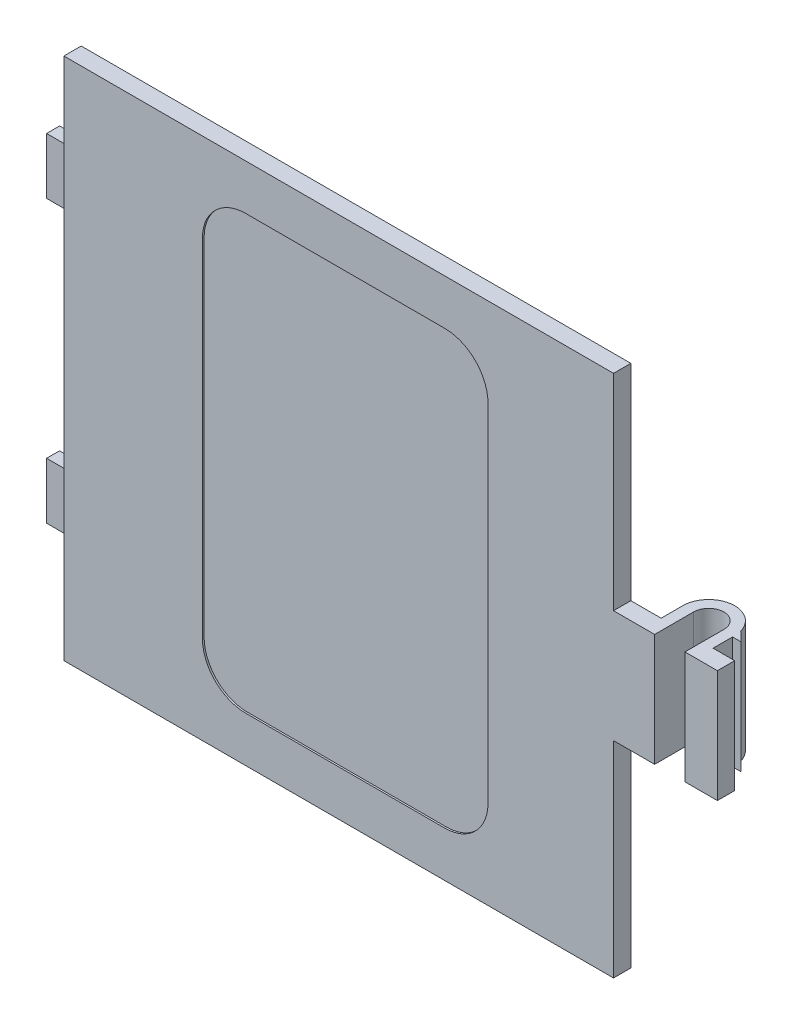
ISO-10303-21;
HEADER;
FILE_DESCRIPTION(('STEP AP214'),'2;1');
FILE_NAME('part.step','',(''),(''),'','','');
FILE_SCHEMA(('AUTOMOTIVE_DESIGN { 1 0 10303 214 1 1 1 1 }'));
ENDSEC;
DATA;
#1=APPLICATION_CONTEXT('core data for automotive mechanical design processes');
#2=APPLICATION_PROTOCOL_DEFINITION('international standard','automotive_design',2000,#1);
#3=PRODUCT_CONTEXT('',#1,'mechanical');
#4=PRODUCT('Part','Part','',(#3));
#5=PRODUCT_RELATED_PRODUCT_CATEGORY('part','',(#4));
#6=PRODUCT_DEFINITION_FORMATION('','',#4);
#7=PRODUCT_DEFINITION_CONTEXT('part definition',#1,'design');
#8=PRODUCT_DEFINITION('design','',#6,#7);
#9=PRODUCT_DEFINITION_SHAPE('','',#8);
#10=(LENGTH_UNIT() NAMED_UNIT(*) SI_UNIT(.MILLI.,.METRE.));
#11=(NAMED_UNIT(*) PLANE_ANGLE_UNIT() SI_UNIT($,.RADIAN.));
#12=(NAMED_UNIT(*) SI_UNIT($,.STERADIAN.) SOLID_ANGLE_UNIT());
#13=UNCERTAINTY_MEASURE_WITH_UNIT(LENGTH_MEASURE(1.E-05),#10,'distance_accuracy_value','');
#14=(GEOMETRIC_REPRESENTATION_CONTEXT(3) GLOBAL_UNCERTAINTY_ASSIGNED_CONTEXT((#13)) GLOBAL_UNIT_ASSIGNED_CONTEXT((#10,
#11,#12)) REPRESENTATION_CONTEXT('',''));
#15=CARTESIAN_POINT('',(0.,0.,0.));
#16=DIRECTION('',(0.,0.,1.));
#17=DIRECTION('',(1.,0.,0.));
#18=AXIS2_PLACEMENT_3D('',#15,#16,#17);
#19=CARTESIAN_POINT('',(21.75,30.25,-89.7068982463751));
#20=DIRECTION('',(1.,0.,0.));
#21=DIRECTION('',(0.,1.,0.));
#22=AXIS2_PLACEMENT_3D('',#19,#20,#21);
#23=PLANE('',#22);
#24=DIRECTION('',(0.,1.,0.));
#25=VECTOR('',#24,1.);
#26=CARTESIAN_POINT('',(21.75,30.25,0.));
#27=LINE('',#26,#25);
#28=CARTESIAN_POINT('',(21.75,6.50000000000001,0.));
#29=VERTEX_POINT('',#28);
#30=CARTESIAN_POINT('',(21.75,30.25,0.));
#31=VERTEX_POINT('',#30);
#32=EDGE_CURVE('E543',#29,#31,#27,.T.);
#33=ORIENTED_EDGE('',*,*,#32,.F.);
#34=DIRECTION('',(0.,0.,-1.));
#35=VECTOR('',#34,1.);
#36=CARTESIAN_POINT('',(21.75,6.50000000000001,-2.));
#37=LINE('',#36,#35);
#38=CARTESIAN_POINT('',(21.75,6.50000000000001,-2.));
#39=VERTEX_POINT('',#38);
#40=EDGE_CURVE('E449',#29,#39,#37,.T.);
#41=ORIENTED_EDGE('',*,*,#40,.T.);
#42=DIRECTION('',(0.,-1.,0.));
#43=VECTOR('',#42,1.);
#44=CARTESIAN_POINT('',(21.75,30.25,-2.));
#45=LINE('',#44,#43);
#46=CARTESIAN_POINT('',(21.75,30.25,-2.));
#47=VERTEX_POINT('',#46);
#48=EDGE_CURVE('E463',#47,#39,#45,.T.);
#49=ORIENTED_EDGE('',*,*,#48,.F.);
#50=DIRECTION('',(0.,0.,1.));
#51=VECTOR('',#50,1.);
#52=CARTESIAN_POINT('',(21.75,30.25,-89.7068982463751));
#53=LINE('',#52,#51);
#54=EDGE_CURVE('E591',#47,#31,#53,.T.);
#55=ORIENTED_EDGE('',*,*,#54,.T.);
#56=EDGE_LOOP('',(#33,#41,#49,#55));
#57=FACE_BOUND('',#56,.T.);
#58=ADVANCED_FACE('F34',(#57),#23,.T.);
#59=CARTESIAN_POINT('',(21.75,-30.25,-89.7068982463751));
#60=DIRECTION('',(0.,-1.,0.));
#61=DIRECTION('',(1.,0.,0.));
#62=AXIS2_PLACEMENT_3D('',#59,#60,#61);
#63=PLANE('',#62);
#64=DIRECTION('',(-1.,0.,0.));
#65=VECTOR('',#64,1.);
#66=CARTESIAN_POINT('',(21.75,-30.25,-2.));
#67=LINE('',#66,#65);
#68=CARTESIAN_POINT('',(21.75,-30.25,-2.));
#69=VERTEX_POINT('',#68);
#70=CARTESIAN_POINT('',(-41.75,-30.25,-2.));
#71=VERTEX_POINT('',#70);
#72=EDGE_CURVE('E492',#69,#71,#67,.T.);
#73=ORIENTED_EDGE('',*,*,#72,.F.);
#74=DIRECTION('',(0.,0.,1.));
#75=VECTOR('',#74,1.);
#76=CARTESIAN_POINT('',(21.75,-30.25,-89.7068982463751));
#77=LINE('',#76,#75);
#78=CARTESIAN_POINT('',(21.75,-30.25,0.));
#79=VERTEX_POINT('',#78);
#80=EDGE_CURVE('E588',#69,#79,#77,.T.);
#81=ORIENTED_EDGE('',*,*,#80,.T.);
#82=DIRECTION('',(1.,0.,0.));
#83=VECTOR('',#82,1.);
#84=CARTESIAN_POINT('',(21.75,-30.25,0.));
#85=LINE('',#84,#83);
#86=CARTESIAN_POINT('',(-41.75,-30.25,0.));
#87=VERTEX_POINT('',#86);
#88=EDGE_CURVE('E508',#87,#79,#85,.T.);
#89=ORIENTED_EDGE('',*,*,#88,.F.);
#90=DIRECTION('',(0.,0.,1.));
#91=VECTOR('',#90,1.);
#92=CARTESIAN_POINT('',(-41.75,-30.25,-89.7068982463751));
#93=LINE('',#92,#91);
#94=EDGE_CURVE('E500',#71,#87,#93,.T.);
#95=ORIENTED_EDGE('',*,*,#94,.F.);
#96=EDGE_LOOP('',(#73,#81,#89,#95));
#97=FACE_BOUND('',#96,.T.);
#98=ADVANCED_FACE('F36',(#97),#63,.T.);
#99=CARTESIAN_POINT('',(-41.75,-30.25,-89.7068982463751));
#100=DIRECTION('',(-1.,0.,0.));
#101=DIRECTION('',(0.,-1.,0.));
#102=AXIS2_PLACEMENT_3D('',#99,#100,#101);
#103=PLANE('',#102);
#104=DIRECTION('',(0.,1.,0.));
#105=VECTOR('',#104,1.);
#106=CARTESIAN_POINT('',(-41.75,-30.25,-2.));
#107=LINE('',#106,#105);
#108=CARTESIAN_POINT('',(-41.75,-19.5,-2.));
#109=VERTEX_POINT('',#108);
#110=EDGE_CURVE('E488',#71,#109,#107,.T.);
#111=ORIENTED_EDGE('',*,*,#110,.F.);
#112=ORIENTED_EDGE('',*,*,#94,.T.);
#113=DIRECTION('',(0.,-1.,0.));
#114=VECTOR('',#113,1.);
#115=CARTESIAN_POINT('',(-41.75,-30.25,0.));
#116=LINE('',#115,#114);
#117=CARTESIAN_POINT('',(-41.75,30.25,0.));
#118=VERTEX_POINT('',#117);
#119=EDGE_CURVE('E586',#118,#87,#116,.T.);
#120=ORIENTED_EDGE('',*,*,#119,.F.);
#121=DIRECTION('',(0.,0.,1.));
#122=VECTOR('',#121,1.);
#123=CARTESIAN_POINT('',(-41.75,30.25,-89.7068982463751));
#124=LINE('',#123,#122);
#125=CARTESIAN_POINT('',(-41.75,30.25,-2.));
#126=VERTEX_POINT('',#125);
#127=EDGE_CURVE('E503',#126,#118,#124,.T.);
#128=ORIENTED_EDGE('',*,*,#127,.F.);
#129=CARTESIAN_POINT('',(-41.75,19.5,-2.));
#130=VERTEX_POINT('',#129);
#131=EDGE_CURVE('E491',#130,#126,#107,.T.);
#132=ORIENTED_EDGE('',*,*,#131,.F.);
#133=CARTESIAN_POINT('',(-41.75,13.,-2.));
#134=VERTEX_POINT('',#133);
#135=EDGE_CURVE('E493',#134,#130,#107,.T.);
#136=ORIENTED_EDGE('',*,*,#135,.F.);
#137=CARTESIAN_POINT('',(-41.75,-13.,-2.));
#138=VERTEX_POINT('',#137);
#139=EDGE_CURVE('E489',#138,#134,#107,.T.);
#140=ORIENTED_EDGE('',*,*,#139,.F.);
#141=EDGE_CURVE('E485',#109,#138,#107,.T.);
#142=ORIENTED_EDGE('',*,*,#141,.F.);
#143=EDGE_LOOP('',(#111,#112,#120,#128,#132,#136,#140,#142));
#144=FACE_BOUND('',#143,.T.);
#145=ADVANCED_FACE('F603',(#144),#103,.T.);
#146=CARTESIAN_POINT('',(-41.75,30.25,-89.7068982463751));
#147=DIRECTION('',(0.,1.,0.));
#148=DIRECTION('',(-1.,0.,0.));
#149=AXIS2_PLACEMENT_3D('',#146,#147,#148);
#150=PLANE('',#149);
#151=DIRECTION('',(1.,0.,0.));
#152=VECTOR('',#151,1.);
#153=CARTESIAN_POINT('',(-41.75,30.25,-2.));
#154=LINE('',#153,#152);
#155=EDGE_CURVE('E496',#126,#47,#154,.T.);
#156=ORIENTED_EDGE('',*,*,#155,.F.);
#157=ORIENTED_EDGE('',*,*,#127,.T.);
#158=DIRECTION('',(-1.,0.,0.));
#159=VECTOR('',#158,1.);
#160=CARTESIAN_POINT('',(-41.75,30.25,0.));
#161=LINE('',#160,#159);
#162=EDGE_CURVE('E580',#31,#118,#161,.T.);
#163=ORIENTED_EDGE('',*,*,#162,.F.);
#164=ORIENTED_EDGE('',*,*,#54,.F.);
#165=EDGE_LOOP('',(#156,#157,#163,#164));
#166=FACE_BOUND('',#165,.T.);
#167=ADVANCED_FACE('F621',(#166),#150,.T.);
#168=DIRECTION('',(0.,0.,-1.));
#169=VECTOR('',#168,1.);
#170=CARTESIAN_POINT('',(21.75,-6.49999999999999,-2.));
#171=LINE('',#170,#169);
#172=CARTESIAN_POINT('',(21.75,-6.49999999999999,0.));
#173=VERTEX_POINT('',#172);
#174=CARTESIAN_POINT('',(21.75,-6.49999999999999,-2.));
#175=VERTEX_POINT('',#174);
#176=EDGE_CURVE('E533',#173,#175,#171,.T.);
#177=ORIENTED_EDGE('',*,*,#176,.F.);
#178=EDGE_CURVE('E578',#79,#173,#27,.T.);
#179=ORIENTED_EDGE('',*,*,#178,.F.);
#180=ORIENTED_EDGE('',*,*,#80,.F.);
#181=EDGE_CURVE('E572',#175,#69,#45,.T.);
#182=ORIENTED_EDGE('',*,*,#181,.F.);
#183=EDGE_LOOP('',(#177,#179,#180,#182));
#184=FACE_BOUND('',#183,.T.);
#185=ADVANCED_FACE('F599',(#184),#23,.T.);
#186=CARTESIAN_POINT('',(21.75,-30.25,0.));
#187=DIRECTION('',(0.,0.,1.));
#188=DIRECTION('',(1.,0.,0.));
#189=AXIS2_PLACEMENT_3D('',#186,#187,#188);
#190=PLANE('',#189);
#191=CARTESIAN_POINT('',(2.25000000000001,-20.,0.));
#192=DIRECTION('',(0.,0.,1.));
#193=DIRECTION('',(-1.,0.,0.));
#194=AXIS2_PLACEMENT_3D('',#191,#192,#193);
#195=CIRCLE('',#194,5.);
#196=CARTESIAN_POINT('',(2.24999999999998,-25.,0.));
#197=VERTEX_POINT('',#196);
#198=CARTESIAN_POINT('',(7.25000000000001,-20.,0.));
#199=VERTEX_POINT('',#198);
#200=EDGE_CURVE('E49',#197,#199,#195,.T.);
#201=ORIENTED_EDGE('',*,*,#200,.F.);
#202=DIRECTION('',(1.,0.,0.));
#203=VECTOR('',#202,1.);
#204=CARTESIAN_POINT('',(-20.75,-25.,0.));
#205=LINE('',#204,#203);
#206=CARTESIAN_POINT('',(-20.75,-25.,0.));
#207=VERTEX_POINT('',#206);
#208=EDGE_CURVE('E293',#207,#197,#205,.T.);
#209=ORIENTED_EDGE('',*,*,#208,.F.);
#210=CARTESIAN_POINT('',(-20.75,-20.,0.));
#211=DIRECTION('',(0.,0.,1.));
#212=DIRECTION('',(-1.,0.,0.));
#213=AXIS2_PLACEMENT_3D('',#210,#211,#212);
#214=CIRCLE('',#213,5.);
#215=CARTESIAN_POINT('',(-25.75,-20.,0.));
#216=VERTEX_POINT('',#215);
#217=EDGE_CURVE('E296',#216,#207,#214,.T.);
#218=ORIENTED_EDGE('',*,*,#217,.F.);
#219=DIRECTION('',(0.,-1.,0.));
#220=VECTOR('',#219,1.);
#221=CARTESIAN_POINT('',(-25.75,-20.,0.));
#222=LINE('',#221,#220);
#223=CARTESIAN_POINT('',(-25.75,20.,0.));
#224=VERTEX_POINT('',#223);
#225=EDGE_CURVE('E324',#224,#216,#222,.T.);
#226=ORIENTED_EDGE('',*,*,#225,.F.);
#227=CARTESIAN_POINT('',(-20.75,20.,0.));
#228=DIRECTION('',(0.,0.,1.));
#229=DIRECTION('',(1.,0.,0.));
#230=AXIS2_PLACEMENT_3D('',#227,#228,#229);
#231=CIRCLE('',#230,5.);
#232=CARTESIAN_POINT('',(-20.75,25.,0.));
#233=VERTEX_POINT('',#232);
#234=EDGE_CURVE('E321',#233,#224,#231,.T.);
#235=ORIENTED_EDGE('',*,*,#234,.F.);
#236=DIRECTION('',(-1.,0.,0.));
#237=VECTOR('',#236,1.);
#238=CARTESIAN_POINT('',(-20.75,25.,0.));
#239=LINE('',#238,#237);
#240=CARTESIAN_POINT('',(2.24999999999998,25.,0.));
#241=VERTEX_POINT('',#240);
#242=EDGE_CURVE('E318',#241,#233,#239,.T.);
#243=ORIENTED_EDGE('',*,*,#242,.F.);
#244=CARTESIAN_POINT('',(2.25000000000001,20.,0.));
#245=DIRECTION('',(0.,0.,1.));
#246=DIRECTION('',(1.,0.,0.));
#247=AXIS2_PLACEMENT_3D('',#244,#245,#246);
#248=CIRCLE('',#247,5.);
#249=CARTESIAN_POINT('',(7.25000000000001,20.,0.));
#250=VERTEX_POINT('',#249);
#251=EDGE_CURVE('E315',#250,#241,#248,.T.);
#252=ORIENTED_EDGE('',*,*,#251,.F.);
#253=DIRECTION('',(0.,1.,0.));
#254=VECTOR('',#253,1.);
#255=CARTESIAN_POINT('',(7.25000000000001,20.,0.));
#256=LINE('',#255,#254);
#257=EDGE_CURVE('E313',#199,#250,#256,.T.);
#258=ORIENTED_EDGE('',*,*,#257,.F.);
#259=EDGE_LOOP('',(#201,#209,#218,#226,#235,#243,#252,#258));
#260=FACE_BOUND('',#259,.T.);
#261=ORIENTED_EDGE('',*,*,#88,.T.);
#262=ORIENTED_EDGE('',*,*,#178,.T.);
#263=DIRECTION('',(-1.,0.,0.));
#264=VECTOR('',#263,1.);
#265=CARTESIAN_POINT('',(21.75,-6.49999999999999,0.));
#266=LINE('',#265,#264);
#267=CARTESIAN_POINT('',(26.5,-6.49999999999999,0.));
#268=VERTEX_POINT('',#267);
#269=EDGE_CURVE('E542',#268,#173,#266,.T.);
#270=ORIENTED_EDGE('',*,*,#269,.F.);
#271=DIRECTION('',(0.,1.,0.));
#272=VECTOR('',#271,1.);
#273=CARTESIAN_POINT('',(26.5,-6.49999999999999,0.));
#274=LINE('',#273,#272);
#275=CARTESIAN_POINT('',(26.5,6.50000000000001,0.));
#276=VERTEX_POINT('',#275);
#277=EDGE_CURVE('E531',#268,#276,#274,.T.);
#278=ORIENTED_EDGE('',*,*,#277,.T.);
#279=DIRECTION('',(-1.,0.,0.));
#280=VECTOR('',#279,1.);
#281=CARTESIAN_POINT('',(21.75,6.50000000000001,0.));
#282=LINE('',#281,#280);
#283=EDGE_CURVE('E443',#276,#29,#282,.T.);
#284=ORIENTED_EDGE('',*,*,#283,.T.);
#285=ORIENTED_EDGE('',*,*,#32,.T.);
#286=ORIENTED_EDGE('',*,*,#162,.T.);
#287=ORIENTED_EDGE('',*,*,#119,.T.);
#288=EDGE_LOOP('',(#261,#262,#270,#278,#284,#285,#286,#287));
#289=FACE_BOUND('',#288,.T.);
#290=ADVANCED_FACE('F558',(#260,#289),#190,.T.);
#291=CARTESIAN_POINT('',(-40.,-30.5,-2.));
#292=DIRECTION('',(0.,0.,1.));
#293=DIRECTION('',(1.,0.,0.));
#294=AXIS2_PLACEMENT_3D('',#291,#292,#293);
#295=PLANE('',#294);
#296=ORIENTED_EDGE('',*,*,#110,.T.);
#297=DIRECTION('',(1.,0.,0.));
#298=VECTOR('',#297,1.);
#299=CARTESIAN_POINT('',(-40.,-19.5,-2.));
#300=LINE('',#299,#298);
#301=CARTESIAN_POINT('',(-39.75,-19.5,-2.));
#302=VERTEX_POINT('',#301);
#303=EDGE_CURVE('E11',#109,#302,#300,.T.);
#304=ORIENTED_EDGE('',*,*,#303,.T.);
#305=DIRECTION('',(0.,1.,0.));
#306=VECTOR('',#305,1.);
#307=CARTESIAN_POINT('',(-39.75,-19.5,-2.));
#308=LINE('',#307,#306);
#309=CARTESIAN_POINT('',(-39.75,-13.,-2.));
#310=VERTEX_POINT('',#309);
#311=EDGE_CURVE('E372',#302,#310,#308,.T.);
#312=ORIENTED_EDGE('',*,*,#311,.T.);
#313=DIRECTION('',(1.,0.,0.));
#314=VECTOR('',#313,1.);
#315=CARTESIAN_POINT('',(-40.,-13.,-2.));
#316=LINE('',#315,#314);
#317=EDGE_CURVE('E42',#138,#310,#316,.T.);
#318=ORIENTED_EDGE('',*,*,#317,.F.);
#319=ORIENTED_EDGE('',*,*,#139,.T.);
#320=DIRECTION('',(-1.,0.,0.));
#321=VECTOR('',#320,1.);
#322=CARTESIAN_POINT('',(-40.,13.,-2.));
#323=LINE('',#322,#321);
#324=CARTESIAN_POINT('',(-39.75,13.,-2.));
#325=VERTEX_POINT('',#324);
#326=EDGE_CURVE('E459',#325,#134,#323,.T.);
#327=ORIENTED_EDGE('',*,*,#326,.F.);
#328=DIRECTION('',(0.,-1.,0.));
#329=VECTOR('',#328,1.);
#330=CARTESIAN_POINT('',(-39.75,19.5,-2.));
#331=LINE('',#330,#329);
#332=CARTESIAN_POINT('',(-39.75,19.5,-2.));
#333=VERTEX_POINT('',#332);
#334=EDGE_CURVE('E386',#333,#325,#331,.T.);
#335=ORIENTED_EDGE('',*,*,#334,.F.);
#336=DIRECTION('',(-1.,0.,0.));
#337=VECTOR('',#336,1.);
#338=CARTESIAN_POINT('',(-40.,19.5,-2.));
#339=LINE('',#338,#337);
#340=EDGE_CURVE('E462',#333,#130,#339,.T.);
#341=ORIENTED_EDGE('',*,*,#340,.T.);
#342=ORIENTED_EDGE('',*,*,#131,.T.);
#343=ORIENTED_EDGE('',*,*,#155,.T.);
#344=ORIENTED_EDGE('',*,*,#48,.T.);
#345=DIRECTION('',(1.,0.,0.));
#346=VECTOR('',#345,1.);
#347=CARTESIAN_POINT('',(21.75,6.50000000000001,-2.));
#348=LINE('',#347,#346);
#349=CARTESIAN_POINT('',(25.25,6.50000000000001,-2.));
#350=VERTEX_POINT('',#349);
#351=EDGE_CURVE('E406',#39,#350,#348,.T.);
#352=ORIENTED_EDGE('',*,*,#351,.T.);
#353=DIRECTION('',(0.,1.,0.));
#354=VECTOR('',#353,1.);
#355=CARTESIAN_POINT('',(25.25,-6.49999999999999,-2.));
#356=LINE('',#355,#354);
#357=CARTESIAN_POINT('',(25.25,-6.49999999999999,-2.));
#358=VERTEX_POINT('',#357);
#359=EDGE_CURVE('E506',#358,#350,#356,.T.);
#360=ORIENTED_EDGE('',*,*,#359,.F.);
#361=DIRECTION('',(1.,0.,0.));
#362=VECTOR('',#361,1.);
#363=CARTESIAN_POINT('',(21.75,-6.49999999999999,-2.));
#364=LINE('',#363,#362);
#365=EDGE_CURVE('E452',#175,#358,#364,.T.);
#366=ORIENTED_EDGE('',*,*,#365,.F.);
#367=ORIENTED_EDGE('',*,*,#181,.T.);
#368=ORIENTED_EDGE('',*,*,#72,.T.);
#369=EDGE_LOOP('',(#296,#304,#312,#318,#319,#327,#335,#341,#342,#343,#344,#352,#360,#366,#367,#368));
#370=FACE_BOUND('',#369,.T.);
#371=ADVANCED_FACE('F570',(#370),#295,.F.);
#372=CARTESIAN_POINT('',(25.25,-6.49999999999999,-2.));
#373=DIRECTION('',(1.,0.,0.));
#374=DIRECTION('',(0.,1.,0.));
#375=AXIS2_PLACEMENT_3D('',#372,#373,#374);
#376=PLANE('',#375);
#377=ORIENTED_EDGE('',*,*,#359,.T.);
#378=DIRECTION('',(0.,0.,-1.));
#379=VECTOR('',#378,1.);
#380=CARTESIAN_POINT('',(25.25,6.50000000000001,-2.));
#381=LINE('',#380,#379);
#382=CARTESIAN_POINT('',(25.25,6.50000000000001,-4.5));
#383=VERTEX_POINT('',#382);
#384=EDGE_CURVE('E407',#350,#383,#381,.T.);
#385=ORIENTED_EDGE('',*,*,#384,.T.);
#386=DIRECTION('',(0.,1.,0.));
#387=VECTOR('',#386,1.);
#388=CARTESIAN_POINT('',(25.25,-6.49999999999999,-4.5));
#389=LINE('',#388,#387);
#390=CARTESIAN_POINT('',(25.25,-6.49999999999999,-4.5));
#391=VERTEX_POINT('',#390);
#392=EDGE_CURVE('E509',#391,#383,#389,.T.);
#393=ORIENTED_EDGE('',*,*,#392,.F.);
#394=DIRECTION('',(0.,0.,-1.));
#395=VECTOR('',#394,1.);
#396=CARTESIAN_POINT('',(25.25,-6.49999999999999,-2.));
#397=LINE('',#396,#395);
#398=EDGE_CURVE('E446',#358,#391,#397,.T.);
#399=ORIENTED_EDGE('',*,*,#398,.F.);
#400=EDGE_LOOP('',(#377,#385,#393,#399));
#401=FACE_BOUND('',#400,.T.);
#402=ADVANCED_FACE('F636',(#401),#376,.F.);
#403=CARTESIAN_POINT('',(28.25,-6.49999999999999,-4.5));
#404=DIRECTION('',(0.,1.,0.));
#405=DIRECTION('',(-1.,0.,0.));
#406=AXIS2_PLACEMENT_3D('',#403,#404,#405);
#407=CYLINDRICAL_SURFACE('',#406,3.);
#408=ORIENTED_EDGE('',*,*,#392,.T.);
#409=CARTESIAN_POINT('',(28.25,6.50000000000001,-4.5));
#410=DIRECTION('',(0.,-1.,0.));
#411=DIRECTION('',(1.,0.,0.));
#412=AXIS2_PLACEMENT_3D('',#409,#410,#411);
#413=CIRCLE('',#412,3.);
#414=CARTESIAN_POINT('',(31.1547375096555,6.50000000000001,-5.25));
#415=VERTEX_POINT('',#414);
#416=EDGE_CURVE('E410',#383,#415,#413,.T.);
#417=ORIENTED_EDGE('',*,*,#416,.T.);
#418=DIRECTION('',(0.,1.,0.));
#419=VECTOR('',#418,1.);
#420=CARTESIAN_POINT('',(31.1547375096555,-6.49999999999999,-5.25));
#421=LINE('',#420,#419);
#422=CARTESIAN_POINT('',(31.1547375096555,-6.49999999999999,-5.25));
#423=VERTEX_POINT('',#422);
#424=EDGE_CURVE('E511',#423,#415,#421,.T.);
#425=ORIENTED_EDGE('',*,*,#424,.F.);
#426=CARTESIAN_POINT('',(28.25,-6.49999999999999,-4.5));
#427=DIRECTION('',(0.,-1.,0.));
#428=DIRECTION('',(1.,0.,0.));
#429=AXIS2_PLACEMENT_3D('',#426,#427,#428);
#430=CIRCLE('',#429,3.);
#431=EDGE_CURVE('E1027',#391,#423,#430,.T.);
#432=ORIENTED_EDGE('',*,*,#431,.F.);
#433=EDGE_LOOP('',(#408,#417,#425,#432));
#434=FACE_BOUND('',#433,.T.);
#435=ADVANCED_FACE('F639',(#434),#407,.T.);
#436=CARTESIAN_POINT('',(31.25,-6.49999999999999,-5.25));
#437=DIRECTION('',(0.,0.,1.));
#438=DIRECTION('',(1.,0.,0.));
#439=AXIS2_PLACEMENT_3D('',#436,#437,#438);
#440=PLANE('',#439);
#441=ORIENTED_EDGE('',*,*,#424,.T.);
#442=DIRECTION('',(1.,0.,0.));
#443=VECTOR('',#442,1.);
#444=CARTESIAN_POINT('',(31.25,6.50000000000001,-5.25));
#445=LINE('',#444,#443);
#446=CARTESIAN_POINT('',(31.25,6.50000000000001,-5.25));
#447=VERTEX_POINT('',#446);
#448=EDGE_CURVE('E413',#415,#447,#445,.T.);
#449=ORIENTED_EDGE('',*,*,#448,.T.);
#450=DIRECTION('',(0.,1.,0.));
#451=VECTOR('',#450,1.);
#452=CARTESIAN_POINT('',(31.25,-6.49999999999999,-5.25));
#453=LINE('',#452,#451);
#454=CARTESIAN_POINT('',(31.25,-6.49999999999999,-5.25));
#455=VERTEX_POINT('',#454);
#456=EDGE_CURVE('E513',#455,#447,#453,.T.);
#457=ORIENTED_EDGE('',*,*,#456,.F.);
#458=DIRECTION('',(1.,0.,0.));
#459=VECTOR('',#458,1.);
#460=CARTESIAN_POINT('',(31.25,-6.49999999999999,-5.25));
#461=LINE('',#460,#459);
#462=EDGE_CURVE('E1028',#423,#455,#461,.T.);
#463=ORIENTED_EDGE('',*,*,#462,.F.);
#464=EDGE_LOOP('',(#441,#449,#457,#463));
#465=FACE_BOUND('',#464,.T.);
#466=ADVANCED_FACE('F643',(#465),#440,.F.);
#467=CARTESIAN_POINT('',(32.25,-6.49999999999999,-4.25));
#468=DIRECTION('',(-0.707106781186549,0.,0.707106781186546));
#469=DIRECTION('',(0.707106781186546,0.,0.707106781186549));
#470=AXIS2_PLACEMENT_3D('',#467,#468,#469);
#471=PLANE('',#470);
#472=ORIENTED_EDGE('',*,*,#456,.T.);
#473=DIRECTION('',(0.707106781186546,0.,0.707106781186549));
#474=VECTOR('',#473,1.);
#475=CARTESIAN_POINT('',(32.25,6.50000000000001,-4.25));
#476=LINE('',#475,#474);
#477=CARTESIAN_POINT('',(32.25,6.50000000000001,-4.25));
#478=VERTEX_POINT('',#477);
#479=EDGE_CURVE('E416',#447,#478,#476,.T.);
#480=ORIENTED_EDGE('',*,*,#479,.T.);
#481=DIRECTION('',(0.,1.,0.));
#482=VECTOR('',#481,1.);
#483=CARTESIAN_POINT('',(32.25,-6.49999999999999,-4.25));
#484=LINE('',#483,#482);
#485=CARTESIAN_POINT('',(32.25,-6.49999999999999,-4.25));
#486=VERTEX_POINT('',#485);
#487=EDGE_CURVE('E515',#486,#478,#484,.T.);
#488=ORIENTED_EDGE('',*,*,#487,.F.);
#489=DIRECTION('',(0.707106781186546,0.,0.707106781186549));
#490=VECTOR('',#489,1.);
#491=CARTESIAN_POINT('',(32.25,-6.49999999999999,-4.25));
#492=LINE('',#491,#490);
#493=EDGE_CURVE('E1029',#455,#486,#492,.T.);
#494=ORIENTED_EDGE('',*,*,#493,.F.);
#495=EDGE_LOOP('',(#472,#480,#488,#494));
#496=FACE_BOUND('',#495,.T.);
#497=ADVANCED_FACE('F647',(#496),#471,.F.);
#498=CARTESIAN_POINT('',(31.25,-6.49999999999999,-4.25));
#499=DIRECTION('',(0.,0.,-1.));
#500=DIRECTION('',(0.,1.,0.));
#501=AXIS2_PLACEMENT_3D('',#498,#499,#500);
#502=PLANE('',#501);
#503=ORIENTED_EDGE('',*,*,#487,.T.);
#504=DIRECTION('',(-1.,0.,0.));
#505=VECTOR('',#504,1.);
#506=CARTESIAN_POINT('',(31.25,6.50000000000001,-4.25));
#507=LINE('',#506,#505);
#508=CARTESIAN_POINT('',(31.25,6.50000000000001,-4.25));
#509=VERTEX_POINT('',#508);
#510=EDGE_CURVE('E419',#478,#509,#507,.T.);
#511=ORIENTED_EDGE('',*,*,#510,.T.);
#512=DIRECTION('',(0.,1.,0.));
#513=VECTOR('',#512,1.);
#514=CARTESIAN_POINT('',(31.25,-6.49999999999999,-4.25));
#515=LINE('',#514,#513);
#516=CARTESIAN_POINT('',(31.25,-6.49999999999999,-4.25));
#517=VERTEX_POINT('',#516);
#518=EDGE_CURVE('E517',#517,#509,#515,.T.);
#519=ORIENTED_EDGE('',*,*,#518,.F.);
#520=DIRECTION('',(-1.,0.,0.));
#521=VECTOR('',#520,1.);
#522=CARTESIAN_POINT('',(31.25,-6.49999999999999,-4.25));
#523=LINE('',#522,#521);
#524=EDGE_CURVE('E1033',#486,#517,#523,.T.);
#525=ORIENTED_EDGE('',*,*,#524,.F.);
#526=EDGE_LOOP('',(#503,#511,#519,#525));
#527=FACE_BOUND('',#526,.T.);
#528=ADVANCED_FACE('F651',(#527),#502,.F.);
#529=CARTESIAN_POINT('',(31.25,-6.49999999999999,-2.));
#530=DIRECTION('',(-1.,0.,0.));
#531=DIRECTION('',(0.,-1.,0.));
#532=AXIS2_PLACEMENT_3D('',#529,#530,#531);
#533=PLANE('',#532);
#534=ORIENTED_EDGE('',*,*,#518,.T.);
#535=DIRECTION('',(0.,0.,1.));
#536=VECTOR('',#535,1.);
#537=CARTESIAN_POINT('',(31.25,6.50000000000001,-2.));
#538=LINE('',#537,#536);
#539=CARTESIAN_POINT('',(31.25,6.50000000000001,-2.));
#540=VERTEX_POINT('',#539);
#541=EDGE_CURVE('E422',#509,#540,#538,.T.);
#542=ORIENTED_EDGE('',*,*,#541,.T.);
#543=DIRECTION('',(0.,1.,0.));
#544=VECTOR('',#543,1.);
#545=CARTESIAN_POINT('',(31.25,-6.49999999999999,-2.));
#546=LINE('',#545,#544);
#547=CARTESIAN_POINT('',(31.25,-6.49999999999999,-2.));
#548=VERTEX_POINT('',#547);
#549=EDGE_CURVE('E519',#548,#540,#546,.T.);
#550=ORIENTED_EDGE('',*,*,#549,.F.);
#551=DIRECTION('',(0.,0.,1.));
#552=VECTOR('',#551,1.);
#553=CARTESIAN_POINT('',(31.25,-6.49999999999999,-2.));
#554=LINE('',#553,#552);
#555=EDGE_CURVE('E1035',#517,#548,#554,.T.);
#556=ORIENTED_EDGE('',*,*,#555,.F.);
#557=EDGE_LOOP('',(#534,#542,#550,#556));
#558=FACE_BOUND('',#557,.T.);
#559=ADVANCED_FACE('F655',(#558),#533,.F.);
#560=CARTESIAN_POINT('',(33.75,-6.49999999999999,-2.));
#561=DIRECTION('',(0.,0.,1.));
#562=DIRECTION('',(1.,0.,0.));
#563=AXIS2_PLACEMENT_3D('',#560,#561,#562);
#564=PLANE('',#563);
#565=ORIENTED_EDGE('',*,*,#549,.T.);
#566=DIRECTION('',(1.,0.,0.));
#567=VECTOR('',#566,1.);
#568=CARTESIAN_POINT('',(33.75,6.50000000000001,-2.));
#569=LINE('',#568,#567);
#570=CARTESIAN_POINT('',(33.75,6.50000000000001,-2.));
#571=VERTEX_POINT('',#570);
#572=EDGE_CURVE('E425',#540,#571,#569,.T.);
#573=ORIENTED_EDGE('',*,*,#572,.T.);
#574=DIRECTION('',(0.,1.,0.));
#575=VECTOR('',#574,1.);
#576=CARTESIAN_POINT('',(33.75,-6.49999999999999,-2.));
#577=LINE('',#576,#575);
#578=CARTESIAN_POINT('',(33.75,-6.49999999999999,-2.));
#579=VERTEX_POINT('',#578);
#580=EDGE_CURVE('E521',#579,#571,#577,.T.);
#581=ORIENTED_EDGE('',*,*,#580,.F.);
#582=DIRECTION('',(1.,0.,0.));
#583=VECTOR('',#582,1.);
#584=CARTESIAN_POINT('',(33.75,-6.49999999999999,-2.));
#585=LINE('',#584,#583);
#586=EDGE_CURVE('E1037',#548,#579,#585,.T.);
#587=ORIENTED_EDGE('',*,*,#586,.F.);
#588=EDGE_LOOP('',(#565,#573,#581,#587));
#589=FACE_BOUND('',#588,.T.);
#590=ADVANCED_FACE('F659',(#589),#564,.F.);
#591=CARTESIAN_POINT('',(33.75,-6.49999999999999,0.));
#592=DIRECTION('',(-1.,0.,0.));
#593=DIRECTION('',(0.,-1.,0.));
#594=AXIS2_PLACEMENT_3D('',#591,#592,#593);
#595=PLANE('',#594);
#596=ORIENTED_EDGE('',*,*,#580,.T.);
#597=DIRECTION('',(0.,0.,1.));
#598=VECTOR('',#597,1.);
#599=CARTESIAN_POINT('',(33.75,6.50000000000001,0.));
#600=LINE('',#599,#598);
#601=CARTESIAN_POINT('',(33.75,6.50000000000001,0.));
#602=VERTEX_POINT('',#601);
#603=EDGE_CURVE('E428',#571,#602,#600,.T.);
#604=ORIENTED_EDGE('',*,*,#603,.T.);
#605=DIRECTION('',(0.,1.,0.));
#606=VECTOR('',#605,1.);
#607=CARTESIAN_POINT('',(33.75,-6.49999999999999,0.));
#608=LINE('',#607,#606);
#609=CARTESIAN_POINT('',(33.75,-6.49999999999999,0.));
#610=VERTEX_POINT('',#609);
#611=EDGE_CURVE('E523',#610,#602,#608,.T.);
#612=ORIENTED_EDGE('',*,*,#611,.F.);
#613=DIRECTION('',(0.,0.,1.));
#614=VECTOR('',#613,1.);
#615=CARTESIAN_POINT('',(33.75,-6.49999999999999,0.));
#616=LINE('',#615,#614);
#617=EDGE_CURVE('E1039',#579,#610,#616,.T.);
#618=ORIENTED_EDGE('',*,*,#617,.F.);
#619=EDGE_LOOP('',(#596,#604,#612,#618));
#620=FACE_BOUND('',#619,.T.);
#621=ADVANCED_FACE('F663',(#620),#595,.F.);
#622=CARTESIAN_POINT('',(30.,-6.49999999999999,0.));
#623=DIRECTION('',(0.,0.,-1.));
#624=DIRECTION('',(0.,1.,0.));
#625=AXIS2_PLACEMENT_3D('',#622,#623,#624);
#626=PLANE('',#625);
#627=ORIENTED_EDGE('',*,*,#611,.T.);
#628=DIRECTION('',(-1.,0.,0.));
#629=VECTOR('',#628,1.);
#630=CARTESIAN_POINT('',(30.,6.50000000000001,0.));
#631=LINE('',#630,#629);
#632=CARTESIAN_POINT('',(30.,6.50000000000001,0.));
#633=VERTEX_POINT('',#632);
#634=EDGE_CURVE('E431',#602,#633,#631,.T.);
#635=ORIENTED_EDGE('',*,*,#634,.T.);
#636=DIRECTION('',(0.,1.,0.));
#637=VECTOR('',#636,1.);
#638=CARTESIAN_POINT('',(30.,-6.49999999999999,0.));
#639=LINE('',#638,#637);
#640=CARTESIAN_POINT('',(30.,-6.49999999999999,0.));
#641=VERTEX_POINT('',#640);
#642=EDGE_CURVE('E525',#641,#633,#639,.T.);
#643=ORIENTED_EDGE('',*,*,#642,.F.);
#644=DIRECTION('',(-1.,0.,0.));
#645=VECTOR('',#644,1.);
#646=CARTESIAN_POINT('',(30.,-6.49999999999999,0.));
#647=LINE('',#646,#645);
#648=EDGE_CURVE('E1041',#610,#641,#647,.T.);
#649=ORIENTED_EDGE('',*,*,#648,.F.);
#650=EDGE_LOOP('',(#627,#635,#643,#649));
#651=FACE_BOUND('',#650,.T.);
#652=ADVANCED_FACE('F667',(#651),#626,.F.);
#653=CARTESIAN_POINT('',(30.,-6.49999999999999,-4.5));
#654=DIRECTION('',(1.,0.,0.));
#655=DIRECTION('',(0.,1.,0.));
#656=AXIS2_PLACEMENT_3D('',#653,#654,#655);
#657=PLANE('',#656);
#658=ORIENTED_EDGE('',*,*,#642,.T.);
#659=DIRECTION('',(0.,0.,-1.));
#660=VECTOR('',#659,1.);
#661=CARTESIAN_POINT('',(30.,6.50000000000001,-4.5));
#662=LINE('',#661,#660);
#663=CARTESIAN_POINT('',(30.,6.50000000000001,-4.5));
#664=VERTEX_POINT('',#663);
#665=EDGE_CURVE('E434',#633,#664,#662,.T.);
#666=ORIENTED_EDGE('',*,*,#665,.T.);
#667=DIRECTION('',(0.,1.,0.));
#668=VECTOR('',#667,1.);
#669=CARTESIAN_POINT('',(30.,-6.49999999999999,-4.5));
#670=LINE('',#669,#668);
#671=CARTESIAN_POINT('',(30.,-6.49999999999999,-4.5));
#672=VERTEX_POINT('',#671);
#673=EDGE_CURVE('E527',#672,#664,#670,.T.);
#674=ORIENTED_EDGE('',*,*,#673,.F.);
#675=DIRECTION('',(0.,0.,-1.));
#676=VECTOR('',#675,1.);
#677=CARTESIAN_POINT('',(30.,-6.49999999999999,-4.5));
#678=LINE('',#677,#676);
#679=EDGE_CURVE('E1043',#641,#672,#678,.T.);
#680=ORIENTED_EDGE('',*,*,#679,.F.);
#681=EDGE_LOOP('',(#658,#666,#674,#680));
#682=FACE_BOUND('',#681,.T.);
#683=ADVANCED_FACE('F671',(#682),#657,.F.);
#684=CARTESIAN_POINT('',(28.25,-6.49999999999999,-4.5));
#685=DIRECTION('',(0.,1.,0.));
#686=DIRECTION('',(-1.,0.,0.));
#687=AXIS2_PLACEMENT_3D('',#684,#685,#686);
#688=CYLINDRICAL_SURFACE('',#687,1.75);
#689=ORIENTED_EDGE('',*,*,#673,.T.);
#690=CARTESIAN_POINT('',(28.25,6.50000000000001,-4.5));
#691=DIRECTION('',(0.,1.,0.));
#692=DIRECTION('',(1.,0.,0.));
#693=AXIS2_PLACEMENT_3D('',#690,#691,#692);
#694=CIRCLE('',#693,1.75);
#695=CARTESIAN_POINT('',(26.5,6.50000000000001,-4.5));
#696=VERTEX_POINT('',#695);
#697=EDGE_CURVE('E437',#664,#696,#694,.T.);
#698=ORIENTED_EDGE('',*,*,#697,.T.);
#699=DIRECTION('',(0.,1.,0.));
#700=VECTOR('',#699,1.);
#701=CARTESIAN_POINT('',(26.5,-6.49999999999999,-4.5));
#702=LINE('',#701,#700);
#703=CARTESIAN_POINT('',(26.5,-6.49999999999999,-4.5));
#704=VERTEX_POINT('',#703);
#705=EDGE_CURVE('E529',#704,#696,#702,.T.);
#706=ORIENTED_EDGE('',*,*,#705,.F.);
#707=CARTESIAN_POINT('',(28.25,-6.49999999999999,-4.5));
#708=DIRECTION('',(0.,1.,0.));
#709=DIRECTION('',(1.,0.,0.));
#710=AXIS2_PLACEMENT_3D('',#707,#708,#709);
#711=CIRCLE('',#710,1.75);
#712=EDGE_CURVE('E1044',#672,#704,#711,.T.);
#713=ORIENTED_EDGE('',*,*,#712,.F.);
#714=EDGE_LOOP('',(#689,#698,#706,#713));
#715=FACE_BOUND('',#714,.T.);
#716=ADVANCED_FACE('F675',(#715),#688,.F.);
#717=CARTESIAN_POINT('',(26.5,-6.49999999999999,0.));
#718=DIRECTION('',(-1.,0.,0.));
#719=DIRECTION('',(0.,0.,1.));
#720=AXIS2_PLACEMENT_3D('',#717,#718,#719);
#721=PLANE('',#720);
#722=ORIENTED_EDGE('',*,*,#705,.T.);
#723=DIRECTION('',(0.,0.,1.));
#724=VECTOR('',#723,1.);
#725=CARTESIAN_POINT('',(26.5,6.50000000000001,0.));
#726=LINE('',#725,#724);
#727=EDGE_CURVE('E440',#696,#276,#726,.T.);
#728=ORIENTED_EDGE('',*,*,#727,.T.);
#729=ORIENTED_EDGE('',*,*,#277,.F.);
#730=DIRECTION('',(0.,0.,1.));
#731=VECTOR('',#730,1.);
#732=CARTESIAN_POINT('',(26.5,-6.49999999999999,0.));
#733=LINE('',#732,#731);
#734=EDGE_CURVE('E536',#704,#268,#733,.T.);
#735=ORIENTED_EDGE('',*,*,#734,.F.);
#736=EDGE_LOOP('',(#722,#728,#729,#735));
#737=FACE_BOUND('',#736,.T.);
#738=ADVANCED_FACE('F679',(#737),#721,.F.);
#739=CARTESIAN_POINT('',(28.25,-6.49999999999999,-4.5));
#740=DIRECTION('',(0.,-1.,0.));
#741=DIRECTION('',(1.,0.,0.));
#742=AXIS2_PLACEMENT_3D('',#739,#740,#741);
#743=PLANE('',#742);
#744=ORIENTED_EDGE('',*,*,#365,.T.);
#745=ORIENTED_EDGE('',*,*,#398,.T.);
#746=ORIENTED_EDGE('',*,*,#431,.T.);
#747=ORIENTED_EDGE('',*,*,#462,.T.);
#748=ORIENTED_EDGE('',*,*,#493,.T.);
#749=ORIENTED_EDGE('',*,*,#524,.T.);
#750=ORIENTED_EDGE('',*,*,#555,.T.);
#751=ORIENTED_EDGE('',*,*,#586,.T.);
#752=ORIENTED_EDGE('',*,*,#617,.T.);
#753=ORIENTED_EDGE('',*,*,#648,.T.);
#754=ORIENTED_EDGE('',*,*,#679,.T.);
#755=ORIENTED_EDGE('',*,*,#712,.T.);
#756=ORIENTED_EDGE('',*,*,#734,.T.);
#757=ORIENTED_EDGE('',*,*,#269,.T.);
#758=ORIENTED_EDGE('',*,*,#176,.T.);
#759=EDGE_LOOP('',(#744,#745,#746,#747,#748,#749,#750,#751,#752,#753,#754,#755,#756,#757,#758));
#760=FACE_BOUND('',#759,.T.);
#761=ADVANCED_FACE('F683',(#760),#743,.T.);
#762=CARTESIAN_POINT('',(28.25,6.50000000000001,-4.5));
#763=DIRECTION('',(0.,-1.,0.));
#764=DIRECTION('',(1.,0.,0.));
#765=AXIS2_PLACEMENT_3D('',#762,#763,#764);
#766=PLANE('',#765);
#767=ORIENTED_EDGE('',*,*,#351,.F.);
#768=ORIENTED_EDGE('',*,*,#40,.F.);
#769=ORIENTED_EDGE('',*,*,#283,.F.);
#770=ORIENTED_EDGE('',*,*,#727,.F.);
#771=ORIENTED_EDGE('',*,*,#697,.F.);
#772=ORIENTED_EDGE('',*,*,#665,.F.);
#773=ORIENTED_EDGE('',*,*,#634,.F.);
#774=ORIENTED_EDGE('',*,*,#603,.F.);
#775=ORIENTED_EDGE('',*,*,#572,.F.);
#776=ORIENTED_EDGE('',*,*,#541,.F.);
#777=ORIENTED_EDGE('',*,*,#510,.F.);
#778=ORIENTED_EDGE('',*,*,#479,.F.);
#779=ORIENTED_EDGE('',*,*,#448,.F.);
#780=ORIENTED_EDGE('',*,*,#416,.F.);
#781=ORIENTED_EDGE('',*,*,#384,.F.);
#782=EDGE_LOOP('',(#767,#768,#769,#770,#771,#772,#773,#774,#775,#776,#777,#778,#779,#780,#781));
#783=FACE_BOUND('',#782,.T.);
#784=ADVANCED_FACE('F566',(#783),#766,.F.);
#785=CARTESIAN_POINT('',(-39.75,19.5,-2.));
#786=DIRECTION('',(-1.,0.,0.));
#787=DIRECTION('',(0.,0.,1.));
#788=AXIS2_PLACEMENT_3D('',#785,#786,#787);
#789=PLANE('',#788);
#790=DIRECTION('',(0.,0.,-1.));
#791=VECTOR('',#790,1.);
#792=CARTESIAN_POINT('',(-39.75,13.,-2.));
#793=LINE('',#792,#791);
#794=CARTESIAN_POINT('',(-39.75,13.,-3.5));
#795=VERTEX_POINT('',#794);
#796=EDGE_CURVE('E374',#325,#795,#793,.T.);
#797=ORIENTED_EDGE('',*,*,#796,.T.);
#798=DIRECTION('',(0.,-1.,0.));
#799=VECTOR('',#798,1.);
#800=CARTESIAN_POINT('',(-39.75,19.5,-3.5));
#801=LINE('',#800,#799);
#802=CARTESIAN_POINT('',(-39.75,19.5,-3.5));
#803=VERTEX_POINT('',#802);
#804=EDGE_CURVE('E403',#803,#795,#801,.T.);
#805=ORIENTED_EDGE('',*,*,#804,.F.);
#806=DIRECTION('',(0.,0.,-1.));
#807=VECTOR('',#806,1.);
#808=CARTESIAN_POINT('',(-39.75,19.5,-2.));
#809=LINE('',#808,#807);
#810=EDGE_CURVE('E375',#333,#803,#809,.T.);
#811=ORIENTED_EDGE('',*,*,#810,.F.);
#812=ORIENTED_EDGE('',*,*,#334,.T.);
#813=EDGE_LOOP('',(#797,#805,#811,#812));
#814=FACE_BOUND('',#813,.T.);
#815=ADVANCED_FACE('F690',(#814),#789,.F.);
#816=CARTESIAN_POINT('',(-39.75,19.5,-3.5));
#817=DIRECTION('',(0.,0.,1.));
#818=DIRECTION('',(1.,0.,0.));
#819=AXIS2_PLACEMENT_3D('',#816,#817,#818);
#820=PLANE('',#819);
#821=DIRECTION('',(-1.,0.,0.));
#822=VECTOR('',#821,1.);
#823=CARTESIAN_POINT('',(-39.75,13.,-3.5));
#824=LINE('',#823,#822);
#825=CARTESIAN_POINT('',(-45.75,13.,-3.5));
#826=VERTEX_POINT('',#825);
#827=EDGE_CURVE('E389',#795,#826,#824,.T.);
#828=ORIENTED_EDGE('',*,*,#827,.T.);
#829=DIRECTION('',(0.,-1.,0.));
#830=VECTOR('',#829,1.);
#831=CARTESIAN_POINT('',(-45.75,19.5,-3.5));
#832=LINE('',#831,#830);
#833=CARTESIAN_POINT('',(-45.75,19.5,-3.5));
#834=VERTEX_POINT('',#833);
#835=EDGE_CURVE('E400',#834,#826,#832,.T.);
#836=ORIENTED_EDGE('',*,*,#835,.F.);
#837=DIRECTION('',(-1.,0.,0.));
#838=VECTOR('',#837,1.);
#839=CARTESIAN_POINT('',(-39.75,19.5,-3.5));
#840=LINE('',#839,#838);
#841=EDGE_CURVE('E378',#803,#834,#840,.T.);
#842=ORIENTED_EDGE('',*,*,#841,.F.);
#843=ORIENTED_EDGE('',*,*,#804,.T.);
#844=EDGE_LOOP('',(#828,#836,#842,#843));
#845=FACE_BOUND('',#844,.T.);
#846=ADVANCED_FACE('F693',(#845),#820,.F.);
#847=CARTESIAN_POINT('',(-45.75,19.5,-2.));
#848=DIRECTION('',(1.,0.,0.));
#849=DIRECTION('',(0.,0.,-1.));
#850=AXIS2_PLACEMENT_3D('',#847,#848,#849);
#851=PLANE('',#850);
#852=DIRECTION('',(0.,0.,1.));
#853=VECTOR('',#852,1.);
#854=CARTESIAN_POINT('',(-45.75,13.,-2.));
#855=LINE('',#854,#853);
#856=CARTESIAN_POINT('',(-45.75,13.,-2.));
#857=VERTEX_POINT('',#856);
#858=EDGE_CURVE('E391',#826,#857,#855,.T.);
#859=ORIENTED_EDGE('',*,*,#858,.T.);
#860=DIRECTION('',(0.,-1.,0.));
#861=VECTOR('',#860,1.);
#862=CARTESIAN_POINT('',(-45.75,19.5,-2.));
#863=LINE('',#862,#861);
#864=CARTESIAN_POINT('',(-45.75,19.5,-2.));
#865=VERTEX_POINT('',#864);
#866=EDGE_CURVE('E397',#865,#857,#863,.T.);
#867=ORIENTED_EDGE('',*,*,#866,.F.);
#868=DIRECTION('',(0.,0.,1.));
#869=VECTOR('',#868,1.);
#870=CARTESIAN_POINT('',(-45.75,19.5,-2.));
#871=LINE('',#870,#869);
#872=EDGE_CURVE('E381',#834,#865,#871,.T.);
#873=ORIENTED_EDGE('',*,*,#872,.F.);
#874=ORIENTED_EDGE('',*,*,#835,.T.);
#875=EDGE_LOOP('',(#859,#867,#873,#874));
#876=FACE_BOUND('',#875,.T.);
#877=ADVANCED_FACE('F697',(#876),#851,.F.);
#878=CARTESIAN_POINT('',(-39.75,19.5,-2.));
#879=DIRECTION('',(0.,0.,-1.));
#880=DIRECTION('',(-1.,0.,0.));
#881=AXIS2_PLACEMENT_3D('',#878,#879,#880);
#882=PLANE('',#881);
#883=ORIENTED_EDGE('',*,*,#135,.T.);
#884=DIRECTION('',(1.,0.,0.));
#885=VECTOR('',#884,1.);
#886=CARTESIAN_POINT('',(-39.75,19.5,-2.));
#887=LINE('',#886,#885);
#888=EDGE_CURVE('E383',#865,#130,#887,.T.);
#889=ORIENTED_EDGE('',*,*,#888,.F.);
#890=ORIENTED_EDGE('',*,*,#866,.T.);
#891=DIRECTION('',(1.,0.,0.));
#892=VECTOR('',#891,1.);
#893=CARTESIAN_POINT('',(-39.75,13.,-2.));
#894=LINE('',#893,#892);
#895=EDGE_CURVE('E379',#857,#134,#894,.T.);
#896=ORIENTED_EDGE('',*,*,#895,.T.);
#897=EDGE_LOOP('',(#883,#889,#890,#896));
#898=FACE_BOUND('',#897,.T.);
#899=ADVANCED_FACE('F701',(#898),#882,.F.);
#900=CARTESIAN_POINT('',(-39.75,19.5,-3.5));
#901=DIRECTION('',(0.,1.,0.));
#902=DIRECTION('',(0.,0.,1.));
#903=AXIS2_PLACEMENT_3D('',#900,#901,#902);
#904=PLANE('',#903);
#905=ORIENTED_EDGE('',*,*,#810,.T.);
#906=ORIENTED_EDGE('',*,*,#841,.T.);
#907=ORIENTED_EDGE('',*,*,#872,.T.);
#908=ORIENTED_EDGE('',*,*,#888,.T.);
#909=ORIENTED_EDGE('',*,*,#340,.F.);
#910=EDGE_LOOP('',(#905,#906,#907,#908,#909));
#911=FACE_BOUND('',#910,.T.);
#912=ADVANCED_FACE('F705',(#911),#904,.T.);
#913=CARTESIAN_POINT('',(-39.75,13.,-3.5));
#914=DIRECTION('',(0.,1.,0.));
#915=DIRECTION('',(0.,0.,1.));
#916=AXIS2_PLACEMENT_3D('',#913,#914,#915);
#917=PLANE('',#916);
#918=ORIENTED_EDGE('',*,*,#796,.F.);
#919=ORIENTED_EDGE('',*,*,#326,.T.);
#920=ORIENTED_EDGE('',*,*,#895,.F.);
#921=ORIENTED_EDGE('',*,*,#858,.F.);
#922=ORIENTED_EDGE('',*,*,#827,.F.);
#923=EDGE_LOOP('',(#918,#919,#920,#921,#922));
#924=FACE_BOUND('',#923,.T.);
#925=ADVANCED_FACE('F707',(#924),#917,.F.);
#926=CARTESIAN_POINT('',(-39.75,-19.5,-2.));
#927=DIRECTION('',(1.,0.,0.));
#928=DIRECTION('',(0.,0.,-1.));
#929=AXIS2_PLACEMENT_3D('',#926,#927,#928);
#930=PLANE('',#929);
#931=DIRECTION('',(0.,0.,-1.));
#932=VECTOR('',#931,1.);
#933=CARTESIAN_POINT('',(-39.75,-13.,-2.));
#934=LINE('',#933,#932);
#935=CARTESIAN_POINT('',(-39.75,-13.,-3.5));
#936=VERTEX_POINT('',#935);
#937=EDGE_CURVE('E331',#310,#936,#934,.T.);
#938=ORIENTED_EDGE('',*,*,#937,.F.);
#939=ORIENTED_EDGE('',*,*,#311,.F.);
#940=DIRECTION('',(0.,0.,-1.));
#941=VECTOR('',#940,1.);
#942=CARTESIAN_POINT('',(-39.75,-19.5,-2.));
#943=LINE('',#942,#941);
#944=CARTESIAN_POINT('',(-39.75,-19.5,-3.5));
#945=VERTEX_POINT('',#944);
#946=EDGE_CURVE('E343',#302,#945,#943,.T.);
#947=ORIENTED_EDGE('',*,*,#946,.T.);
#948=DIRECTION('',(0.,1.,0.));
#949=VECTOR('',#948,1.);
#950=CARTESIAN_POINT('',(-39.75,-19.5,-3.5));
#951=LINE('',#950,#949);
#952=EDGE_CURVE('E356',#945,#936,#951,.T.);
#953=ORIENTED_EDGE('',*,*,#952,.T.);
#954=EDGE_LOOP('',(#938,#939,#947,#953));
#955=FACE_BOUND('',#954,.T.);
#956=ADVANCED_FACE('F472',(#955),#930,.T.);
#957=CARTESIAN_POINT('',(-39.75,-19.5,-2.));
#958=DIRECTION('',(0.,0.,1.));
#959=DIRECTION('',(1.,0.,0.));
#960=AXIS2_PLACEMENT_3D('',#957,#958,#959);
#961=PLANE('',#960);
#962=DIRECTION('',(1.,0.,0.));
#963=VECTOR('',#962,1.);
#964=CARTESIAN_POINT('',(-39.75,-19.5,-2.));
#965=LINE('',#964,#963);
#966=CARTESIAN_POINT('',(-45.75,-19.5,-2.));
#967=VERTEX_POINT('',#966);
#968=EDGE_CURVE('E346',#967,#109,#965,.T.);
#969=ORIENTED_EDGE('',*,*,#968,.T.);
#970=ORIENTED_EDGE('',*,*,#141,.T.);
#971=DIRECTION('',(1.,0.,0.));
#972=VECTOR('',#971,1.);
#973=CARTESIAN_POINT('',(-39.75,-13.,-2.));
#974=LINE('',#973,#972);
#975=CARTESIAN_POINT('',(-45.75,-13.,-2.));
#976=VERTEX_POINT('',#975);
#977=EDGE_CURVE('E359',#976,#138,#974,.T.);
#978=ORIENTED_EDGE('',*,*,#977,.F.);
#979=DIRECTION('',(0.,1.,0.));
#980=VECTOR('',#979,1.);
#981=CARTESIAN_POINT('',(-45.75,-19.5,-2.));
#982=LINE('',#981,#980);
#983=EDGE_CURVE('E370',#967,#976,#982,.T.);
#984=ORIENTED_EDGE('',*,*,#983,.F.);
#985=EDGE_LOOP('',(#969,#970,#978,#984));
#986=FACE_BOUND('',#985,.T.);
#987=ADVANCED_FACE('F484',(#986),#961,.T.);
#988=CARTESIAN_POINT('',(-45.75,-19.5,-2.));
#989=DIRECTION('',(-1.,0.,0.));
#990=DIRECTION('',(0.,0.,1.));
#991=AXIS2_PLACEMENT_3D('',#988,#989,#990);
#992=PLANE('',#991);
#993=DIRECTION('',(0.,0.,1.));
#994=VECTOR('',#993,1.);
#995=CARTESIAN_POINT('',(-45.75,-13.,-2.));
#996=LINE('',#995,#994);
#997=CARTESIAN_POINT('',(-45.75,-13.,-3.5));
#998=VERTEX_POINT('',#997);
#999=EDGE_CURVE('E362',#998,#976,#996,.T.);
#1000=ORIENTED_EDGE('',*,*,#999,.F.);
#1001=DIRECTION('',(0.,1.,0.));
#1002=VECTOR('',#1001,1.);
#1003=CARTESIAN_POINT('',(-45.75,-19.5,-3.5));
#1004=LINE('',#1003,#1002);
#1005=CARTESIAN_POINT('',(-45.75,-19.5,-3.5));
#1006=VERTEX_POINT('',#1005);
#1007=EDGE_CURVE('E368',#1006,#998,#1004,.T.);
#1008=ORIENTED_EDGE('',*,*,#1007,.F.);
#1009=DIRECTION('',(0.,0.,1.));
#1010=VECTOR('',#1009,1.);
#1011=CARTESIAN_POINT('',(-45.75,-19.5,-2.));
#1012=LINE('',#1011,#1010);
#1013=EDGE_CURVE('E350',#1006,#967,#1012,.T.);
#1014=ORIENTED_EDGE('',*,*,#1013,.T.);
#1015=ORIENTED_EDGE('',*,*,#983,.T.);
#1016=EDGE_LOOP('',(#1000,#1008,#1014,#1015));
#1017=FACE_BOUND('',#1016,.T.);
#1018=ADVANCED_FACE('F479',(#1017),#992,.T.);
#1019=CARTESIAN_POINT('',(-39.75,-19.5,-3.5));
#1020=DIRECTION('',(0.,0.,-1.));
#1021=DIRECTION('',(-1.,0.,0.));
#1022=AXIS2_PLACEMENT_3D('',#1019,#1020,#1021);
#1023=PLANE('',#1022);
#1024=DIRECTION('',(-1.,0.,0.));
#1025=VECTOR('',#1024,1.);
#1026=CARTESIAN_POINT('',(-39.75,-13.,-3.5));
#1027=LINE('',#1026,#1025);
#1028=EDGE_CURVE('E347',#936,#998,#1027,.T.);
#1029=ORIENTED_EDGE('',*,*,#1028,.F.);
#1030=ORIENTED_EDGE('',*,*,#952,.F.);
#1031=DIRECTION('',(-1.,0.,0.));
#1032=VECTOR('',#1031,1.);
#1033=CARTESIAN_POINT('',(-39.75,-19.5,-3.5));
#1034=LINE('',#1033,#1032);
#1035=EDGE_CURVE('E353',#945,#1006,#1034,.T.);
#1036=ORIENTED_EDGE('',*,*,#1035,.T.);
#1037=ORIENTED_EDGE('',*,*,#1007,.T.);
#1038=EDGE_LOOP('',(#1029,#1030,#1036,#1037));
#1039=FACE_BOUND('',#1038,.T.);
#1040=ADVANCED_FACE('F476',(#1039),#1023,.T.);
#1041=CARTESIAN_POINT('',(-39.75,-19.5,-3.5));
#1042=DIRECTION('',(0.,-1.,0.));
#1043=DIRECTION('',(0.,0.,1.));
#1044=AXIS2_PLACEMENT_3D('',#1041,#1042,#1043);
#1045=PLANE('',#1044);
#1046=ORIENTED_EDGE('',*,*,#946,.F.);
#1047=ORIENTED_EDGE('',*,*,#303,.F.);
#1048=ORIENTED_EDGE('',*,*,#968,.F.);
#1049=ORIENTED_EDGE('',*,*,#1013,.F.);
#1050=ORIENTED_EDGE('',*,*,#1035,.F.);
#1051=EDGE_LOOP('',(#1046,#1047,#1048,#1049,#1050));
#1052=FACE_BOUND('',#1051,.T.);
#1053=ADVANCED_FACE('F605',(#1052),#1045,.T.);
#1054=CARTESIAN_POINT('',(-39.75,-13.,-3.5));
#1055=DIRECTION('',(0.,-1.,0.));
#1056=DIRECTION('',(0.,0.,1.));
#1057=AXIS2_PLACEMENT_3D('',#1054,#1055,#1056);
#1058=PLANE('',#1057);
#1059=ORIENTED_EDGE('',*,*,#937,.T.);
#1060=ORIENTED_EDGE('',*,*,#1028,.T.);
#1061=ORIENTED_EDGE('',*,*,#999,.T.);
#1062=ORIENTED_EDGE('',*,*,#977,.T.);
#1063=ORIENTED_EDGE('',*,*,#317,.T.);
#1064=EDGE_LOOP('',(#1059,#1060,#1061,#1062,#1063));
#1065=FACE_BOUND('',#1064,.T.);
#1066=ADVANCED_FACE('F467',(#1065),#1058,.F.);
#1067=CARTESIAN_POINT('',(2.25000000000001,-20.,-0.2));
#1068=DIRECTION('',(0.,0.,1.));
#1069=DIRECTION('',(1.,0.,0.));
#1070=AXIS2_PLACEMENT_3D('',#1067,#1068,#1069);
#1071=CYLINDRICAL_SURFACE('',#1070,5.);
#1072=ORIENTED_EDGE('',*,*,#200,.T.);
#1073=DIRECTION('',(0.,0.,1.));
#1074=VECTOR('',#1073,1.);
#1075=CARTESIAN_POINT('',(7.25000000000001,-20.,-0.2));
#1076=LINE('',#1075,#1074);
#1077=CARTESIAN_POINT('',(7.25000000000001,-20.,-0.2));
#1078=VERTEX_POINT('',#1077);
#1079=EDGE_CURVE('E270',#1078,#199,#1076,.T.);
#1080=ORIENTED_EDGE('',*,*,#1079,.F.);
#1081=CARTESIAN_POINT('',(2.25000000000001,-20.,-0.2));
#1082=DIRECTION('',(0.,0.,1.));
#1083=DIRECTION('',(-1.,0.,0.));
#1084=AXIS2_PLACEMENT_3D('',#1081,#1082,#1083);
#1085=CIRCLE('',#1084,5.);
#1086=CARTESIAN_POINT('',(2.24999999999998,-25.,-0.2));
#1087=VERTEX_POINT('',#1086);
#1088=EDGE_CURVE('E274',#1087,#1078,#1085,.T.);
#1089=ORIENTED_EDGE('',*,*,#1088,.F.);
#1090=DIRECTION('',(0.,0.,1.));
#1091=VECTOR('',#1090,1.);
#1092=CARTESIAN_POINT('',(2.24999999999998,-25.,-0.2));
#1093=LINE('',#1092,#1091);
#1094=EDGE_CURVE('E329',#1087,#197,#1093,.T.);
#1095=ORIENTED_EDGE('',*,*,#1094,.T.);
#1096=EDGE_LOOP('',(#1072,#1080,#1089,#1095));
#1097=FACE_BOUND('',#1096,.T.);
#1098=ADVANCED_FACE('F272',(#1097),#1071,.F.);
#1099=CARTESIAN_POINT('',(-20.75,-25.,-0.2));
#1100=DIRECTION('',(0.,-1.,0.));
#1101=DIRECTION('',(0.,0.,-1.));
#1102=AXIS2_PLACEMENT_3D('',#1099,#1100,#1101);
#1103=PLANE('',#1102);
#1104=ORIENTED_EDGE('',*,*,#208,.T.);
#1105=ORIENTED_EDGE('',*,*,#1094,.F.);
#1106=DIRECTION('',(1.,0.,0.));
#1107=VECTOR('',#1106,1.);
#1108=CARTESIAN_POINT('',(-20.75,-25.,-0.2));
#1109=LINE('',#1108,#1107);
#1110=CARTESIAN_POINT('',(-20.75,-25.,-0.2));
#1111=VERTEX_POINT('',#1110);
#1112=EDGE_CURVE('E280',#1111,#1087,#1109,.T.);
#1113=ORIENTED_EDGE('',*,*,#1112,.F.);
#1114=DIRECTION('',(0.,0.,1.));
#1115=VECTOR('',#1114,1.);
#1116=CARTESIAN_POINT('',(-20.75,-25.,-0.2));
#1117=LINE('',#1116,#1115);
#1118=EDGE_CURVE('E332',#1111,#207,#1117,.T.);
#1119=ORIENTED_EDGE('',*,*,#1118,.T.);
#1120=EDGE_LOOP('',(#1104,#1105,#1113,#1119));
#1121=FACE_BOUND('',#1120,.T.);
#1122=ADVANCED_FACE('F755',(#1121),#1103,.F.);
#1123=CARTESIAN_POINT('',(-20.75,-20.,-0.2));
#1124=DIRECTION('',(0.,0.,1.));
#1125=DIRECTION('',(1.,0.,0.));
#1126=AXIS2_PLACEMENT_3D('',#1123,#1124,#1125);
#1127=CYLINDRICAL_SURFACE('',#1126,5.);
#1128=ORIENTED_EDGE('',*,*,#217,.T.);
#1129=ORIENTED_EDGE('',*,*,#1118,.F.);
#1130=CARTESIAN_POINT('',(-20.75,-20.,-0.2));
#1131=DIRECTION('',(0.,0.,1.));
#1132=DIRECTION('',(-1.,0.,0.));
#1133=AXIS2_PLACEMENT_3D('',#1130,#1131,#1132);
#1134=CIRCLE('',#1133,5.);
#1135=CARTESIAN_POINT('',(-25.75,-20.,-0.2));
#1136=VERTEX_POINT('',#1135);
#1137=EDGE_CURVE('E309',#1136,#1111,#1134,.T.);
#1138=ORIENTED_EDGE('',*,*,#1137,.F.);
#1139=DIRECTION('',(0.,0.,1.));
#1140=VECTOR('',#1139,1.);
#1141=CARTESIAN_POINT('',(-25.75,-20.,-0.2));
#1142=LINE('',#1141,#1140);
#1143=EDGE_CURVE('E334',#1136,#216,#1142,.T.);
#1144=ORIENTED_EDGE('',*,*,#1143,.T.);
#1145=EDGE_LOOP('',(#1128,#1129,#1138,#1144));
#1146=FACE_BOUND('',#1145,.T.);
#1147=ADVANCED_FACE('F763',(#1146),#1127,.F.);
#1148=CARTESIAN_POINT('',(-25.75,-20.,-0.2));
#1149=DIRECTION('',(-1.,0.,0.));
#1150=DIRECTION('',(0.,0.,1.));
#1151=AXIS2_PLACEMENT_3D('',#1148,#1149,#1150);
#1152=PLANE('',#1151);
#1153=ORIENTED_EDGE('',*,*,#225,.T.);
#1154=ORIENTED_EDGE('',*,*,#1143,.F.);
#1155=DIRECTION('',(0.,-1.,0.));
#1156=VECTOR('',#1155,1.);
#1157=CARTESIAN_POINT('',(-25.75,-20.,-0.2));
#1158=LINE('',#1157,#1156);
#1159=CARTESIAN_POINT('',(-25.75,20.,-0.2));
#1160=VERTEX_POINT('',#1159);
#1161=EDGE_CURVE('E306',#1160,#1136,#1158,.T.);
#1162=ORIENTED_EDGE('',*,*,#1161,.F.);
#1163=DIRECTION('',(0.,0.,1.));
#1164=VECTOR('',#1163,1.);
#1165=CARTESIAN_POINT('',(-25.75,20.,-0.2));
#1166=LINE('',#1165,#1164);
#1167=EDGE_CURVE('E336',#1160,#224,#1166,.T.);
#1168=ORIENTED_EDGE('',*,*,#1167,.T.);
#1169=EDGE_LOOP('',(#1153,#1154,#1162,#1168));
#1170=FACE_BOUND('',#1169,.T.);
#1171=ADVANCED_FACE('F773',(#1170),#1152,.F.);
#1172=CARTESIAN_POINT('',(-20.75,20.,-0.2));
#1173=DIRECTION('',(0.,0.,1.));
#1174=DIRECTION('',(1.,0.,0.));
#1175=AXIS2_PLACEMENT_3D('',#1172,#1173,#1174);
#1176=CYLINDRICAL_SURFACE('',#1175,5.);
#1177=ORIENTED_EDGE('',*,*,#234,.T.);
#1178=ORIENTED_EDGE('',*,*,#1167,.F.);
#1179=CARTESIAN_POINT('',(-20.75,20.,-0.2));
#1180=DIRECTION('',(0.,0.,1.));
#1181=DIRECTION('',(1.,0.,0.));
#1182=AXIS2_PLACEMENT_3D('',#1179,#1180,#1181);
#1183=CIRCLE('',#1182,5.);
#1184=CARTESIAN_POINT('',(-20.75,25.,-0.2));
#1185=VERTEX_POINT('',#1184);
#1186=EDGE_CURVE('E303',#1185,#1160,#1183,.T.);
#1187=ORIENTED_EDGE('',*,*,#1186,.F.);
#1188=DIRECTION('',(0.,0.,1.));
#1189=VECTOR('',#1188,1.);
#1190=CARTESIAN_POINT('',(-20.75,25.,-0.2));
#1191=LINE('',#1190,#1189);
#1192=EDGE_CURVE('E338',#1185,#233,#1191,.T.);
#1193=ORIENTED_EDGE('',*,*,#1192,.T.);
#1194=EDGE_LOOP('',(#1177,#1178,#1187,#1193));
#1195=FACE_BOUND('',#1194,.T.);
#1196=ADVANCED_FACE('F783',(#1195),#1176,.F.);
#1197=CARTESIAN_POINT('',(-20.75,25.,-0.2));
#1198=DIRECTION('',(0.,1.,0.));
#1199=DIRECTION('',(0.,0.,1.));
#1200=AXIS2_PLACEMENT_3D('',#1197,#1198,#1199);
#1201=PLANE('',#1200);
#1202=ORIENTED_EDGE('',*,*,#242,.T.);
#1203=ORIENTED_EDGE('',*,*,#1192,.F.);
#1204=DIRECTION('',(-1.,0.,0.));
#1205=VECTOR('',#1204,1.);
#1206=CARTESIAN_POINT('',(-20.75,25.,-0.2));
#1207=LINE('',#1206,#1205);
#1208=CARTESIAN_POINT('',(2.24999999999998,25.,-0.2));
#1209=VERTEX_POINT('',#1208);
#1210=EDGE_CURVE('E300',#1209,#1185,#1207,.T.);
#1211=ORIENTED_EDGE('',*,*,#1210,.F.);
#1212=DIRECTION('',(0.,0.,1.));
#1213=VECTOR('',#1212,1.);
#1214=CARTESIAN_POINT('',(2.24999999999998,25.,-0.2));
#1215=LINE('',#1214,#1213);
#1216=EDGE_CURVE('E340',#1209,#241,#1215,.T.);
#1217=ORIENTED_EDGE('',*,*,#1216,.T.);
#1218=EDGE_LOOP('',(#1202,#1203,#1211,#1217));
#1219=FACE_BOUND('',#1218,.T.);
#1220=ADVANCED_FACE('F793',(#1219),#1201,.F.);
#1221=CARTESIAN_POINT('',(2.25000000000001,20.,-0.2));
#1222=DIRECTION('',(0.,0.,1.));
#1223=DIRECTION('',(1.,0.,0.));
#1224=AXIS2_PLACEMENT_3D('',#1221,#1222,#1223);
#1225=CYLINDRICAL_SURFACE('',#1224,5.);
#1226=ORIENTED_EDGE('',*,*,#251,.T.);
#1227=ORIENTED_EDGE('',*,*,#1216,.F.);
#1228=CARTESIAN_POINT('',(2.25000000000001,20.,-0.2));
#1229=DIRECTION('',(0.,0.,1.));
#1230=DIRECTION('',(1.,0.,0.));
#1231=AXIS2_PLACEMENT_3D('',#1228,#1229,#1230);
#1232=CIRCLE('',#1231,5.);
#1233=CARTESIAN_POINT('',(7.25000000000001,20.,-0.2));
#1234=VERTEX_POINT('',#1233);
#1235=EDGE_CURVE('E288',#1234,#1209,#1232,.T.);
#1236=ORIENTED_EDGE('',*,*,#1235,.F.);
#1237=DIRECTION('',(0.,0.,1.));
#1238=VECTOR('',#1237,1.);
#1239=CARTESIAN_POINT('',(7.25000000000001,20.,-0.2));
#1240=LINE('',#1239,#1238);
#1241=EDGE_CURVE('E279',#1234,#250,#1240,.T.);
#1242=ORIENTED_EDGE('',*,*,#1241,.T.);
#1243=EDGE_LOOP('',(#1226,#1227,#1236,#1242));
#1244=FACE_BOUND('',#1243,.T.);
#1245=ADVANCED_FACE('F803',(#1244),#1225,.F.);
#1246=CARTESIAN_POINT('',(7.25000000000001,20.,-0.2));
#1247=DIRECTION('',(1.,0.,0.));
#1248=DIRECTION('',(0.,0.,-1.));
#1249=AXIS2_PLACEMENT_3D('',#1246,#1247,#1248);
#1250=PLANE('',#1249);
#1251=ORIENTED_EDGE('',*,*,#257,.T.);
#1252=ORIENTED_EDGE('',*,*,#1241,.F.);
#1253=DIRECTION('',(0.,1.,0.));
#1254=VECTOR('',#1253,1.);
#1255=CARTESIAN_POINT('',(7.25000000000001,20.,-0.2));
#1256=LINE('',#1255,#1254);
#1257=EDGE_CURVE('E283',#1078,#1234,#1256,.T.);
#1258=ORIENTED_EDGE('',*,*,#1257,.F.);
#1259=ORIENTED_EDGE('',*,*,#1079,.T.);
#1260=EDGE_LOOP('',(#1251,#1252,#1258,#1259));
#1261=FACE_BOUND('',#1260,.T.);
#1262=ADVANCED_FACE('F284',(#1261),#1250,.F.);
#1263=CARTESIAN_POINT('',(2.25000000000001,-20.,-0.2));
#1264=DIRECTION('',(0.,0.,-1.));
#1265=DIRECTION('',(-1.,0.,0.));
#1266=AXIS2_PLACEMENT_3D('',#1263,#1264,#1265);
#1267=PLANE('',#1266);
#1268=ORIENTED_EDGE('',*,*,#1088,.T.);
#1269=ORIENTED_EDGE('',*,*,#1257,.T.);
#1270=ORIENTED_EDGE('',*,*,#1235,.T.);
#1271=ORIENTED_EDGE('',*,*,#1210,.T.);
#1272=ORIENTED_EDGE('',*,*,#1186,.T.);
#1273=ORIENTED_EDGE('',*,*,#1161,.T.);
#1274=ORIENTED_EDGE('',*,*,#1137,.T.);
#1275=ORIENTED_EDGE('',*,*,#1112,.T.);
#1276=EDGE_LOOP('',(#1268,#1269,#1270,#1271,#1272,#1273,#1274,#1275));
#1277=FACE_BOUND('',#1276,.T.);
#1278=ADVANCED_FACE('F290',(#1277),#1267,.F.);
#1279=CLOSED_SHELL('',(#58,#98,#145,#167,#185,#290,#371,#402,#435,#466,#497,#528,#559,#590,#621,
#652,#683,#716,#738,#761,#784,#815,#846,#877,#899,#912,#925,#956,#987,#1018,#1040,#1053,#1066,
#1098,#1122,#1147,#1171,#1196,#1220,#1245,#1262,#1278));
#1280=MANIFOLD_SOLID_BREP('B2',#1279);
#1281=ADVANCED_BREP_SHAPE_REPRESENTATION('',(#18,#1280),#14);
#1282=SHAPE_DEFINITION_REPRESENTATION(#9,#1281);
ENDSEC;
END-ISO-10303-21;
